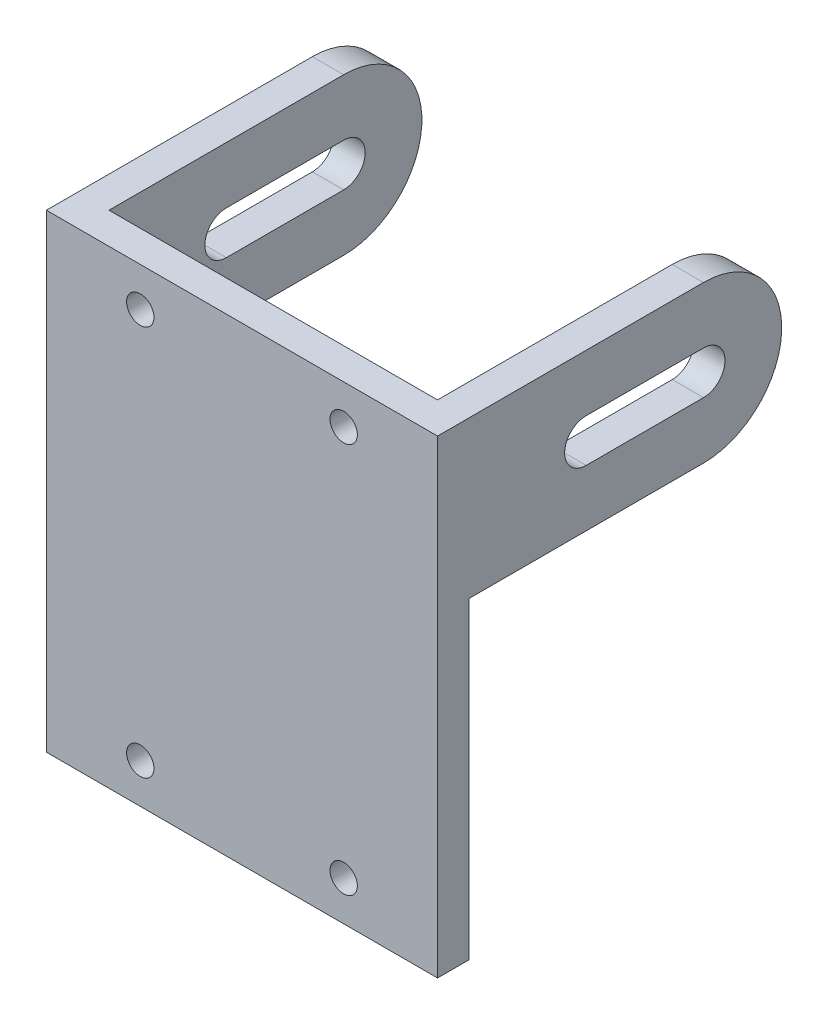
ISO-10303-21;
HEADER;
FILE_DESCRIPTION(('STEP AP214'),'2;1');
FILE_NAME('part.step','',(''),(''),'','','');
FILE_SCHEMA(('AUTOMOTIVE_DESIGN { 1 0 10303 214 1 1 1 1 }'));
ENDSEC;
DATA;
#1=APPLICATION_CONTEXT('core data for automotive mechanical design processes');
#2=APPLICATION_PROTOCOL_DEFINITION('international standard','automotive_design',2000,#1);
#3=PRODUCT_CONTEXT('',#1,'mechanical');
#4=PRODUCT('Part','Part','',(#3));
#5=PRODUCT_RELATED_PRODUCT_CATEGORY('part','',(#4));
#6=PRODUCT_DEFINITION_FORMATION('','',#4);
#7=PRODUCT_DEFINITION_CONTEXT('part definition',#1,'design');
#8=PRODUCT_DEFINITION('design','',#6,#7);
#9=PRODUCT_DEFINITION_SHAPE('','',#8);
#10=(LENGTH_UNIT() NAMED_UNIT(*) SI_UNIT(.MILLI.,.METRE.));
#11=(NAMED_UNIT(*) PLANE_ANGLE_UNIT() SI_UNIT($,.RADIAN.));
#12=(NAMED_UNIT(*) SI_UNIT($,.STERADIAN.) SOLID_ANGLE_UNIT());
#13=UNCERTAINTY_MEASURE_WITH_UNIT(LENGTH_MEASURE(1.E-05),#10,'distance_accuracy_value','');
#14=(GEOMETRIC_REPRESENTATION_CONTEXT(3) GLOBAL_UNCERTAINTY_ASSIGNED_CONTEXT((#13)) GLOBAL_UNIT_ASSIGNED_CONTEXT((#10,
#11,#12)) REPRESENTATION_CONTEXT('',''));
#15=CARTESIAN_POINT('',(0.,0.,0.));
#16=DIRECTION('',(0.,0.,1.));
#17=DIRECTION('',(1.,0.,0.));
#18=AXIS2_PLACEMENT_3D('',#15,#16,#17);
#19=CARTESIAN_POINT('',(0.,0.,0.));
#20=DIRECTION('',(0.,0.,1.));
#21=DIRECTION('',(1.,0.,0.));
#22=AXIS2_PLACEMENT_3D('',#19,#20,#21);
#23=PLANE('',#22);
#24=CARTESIAN_POINT('',(38.,-5.,0.));
#25=DIRECTION('',(0.,0.,1.));
#26=DIRECTION('',(-1.,0.,0.));
#27=AXIS2_PLACEMENT_3D('',#24,#25,#26);
#28=CIRCLE('',#27,1.75);
#29=CARTESIAN_POINT('',(36.25,-5.,0.));
#30=VERTEX_POINT('',#29);
#31=EDGE_CURVE('E327',#30,#30,#28,.T.);
#32=ORIENTED_EDGE('',*,*,#31,.T.);
#33=EDGE_LOOP('',(#32));
#34=FACE_BOUND('',#33,.T.);
#35=CARTESIAN_POINT('',(38.,-54.9374608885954,0.));
#36=DIRECTION('',(0.,0.,1.));
#37=DIRECTION('',(-1.,0.,0.));
#38=AXIS2_PLACEMENT_3D('',#35,#36,#37);
#39=CIRCLE('',#38,1.75);
#40=CARTESIAN_POINT('',(36.25,-54.9374608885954,0.));
#41=VERTEX_POINT('',#40);
#42=EDGE_CURVE('E338',#41,#41,#39,.T.);
#43=ORIENTED_EDGE('',*,*,#42,.T.);
#44=EDGE_LOOP('',(#43));
#45=FACE_BOUND('',#44,.T.);
#46=CARTESIAN_POINT('',(12.,-54.9374608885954,0.));
#47=DIRECTION('',(0.,0.,1.));
#48=DIRECTION('',(1.,0.,0.));
#49=AXIS2_PLACEMENT_3D('',#46,#47,#48);
#50=CIRCLE('',#49,1.75);
#51=CARTESIAN_POINT('',(13.75,-54.9374608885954,0.));
#52=VERTEX_POINT('',#51);
#53=EDGE_CURVE('E346',#52,#52,#50,.T.);
#54=ORIENTED_EDGE('',*,*,#53,.T.);
#55=EDGE_LOOP('',(#54));
#56=FACE_BOUND('',#55,.T.);
#57=CARTESIAN_POINT('',(12.,-5.,0.));
#58=DIRECTION('',(0.,0.,1.));
#59=DIRECTION('',(1.,0.,0.));
#60=AXIS2_PLACEMENT_3D('',#57,#58,#59);
#61=CIRCLE('',#60,1.75);
#62=CARTESIAN_POINT('',(13.75,-5.,0.));
#63=VERTEX_POINT('',#62);
#64=EDGE_CURVE('E354',#63,#63,#61,.T.);
#65=ORIENTED_EDGE('',*,*,#64,.T.);
#66=EDGE_LOOP('',(#65));
#67=FACE_BOUND('',#66,.T.);
#68=DIRECTION('',(0.,-1.,0.));
#69=VECTOR('',#68,1.);
#70=CARTESIAN_POINT('',(46.,0.,0.));
#71=LINE('',#70,#69);
#72=CARTESIAN_POINT('',(46.,0.,0.));
#73=VERTEX_POINT('',#72);
#74=CARTESIAN_POINT('',(46.,-20.,0.));
#75=VERTEX_POINT('',#74);
#76=EDGE_CURVE('E226',#73,#75,#71,.T.);
#77=ORIENTED_EDGE('',*,*,#76,.T.);
#78=DIRECTION('',(1.,0.,0.));
#79=VECTOR('',#78,1.);
#80=CARTESIAN_POINT('',(46.,-20.,0.));
#81=LINE('',#80,#79);
#82=CARTESIAN_POINT('',(50.,-20.,0.));
#83=VERTEX_POINT('',#82);
#84=EDGE_CURVE('E239',#75,#83,#81,.T.);
#85=ORIENTED_EDGE('',*,*,#84,.T.);
#86=DIRECTION('',(0.,1.,0.));
#87=VECTOR('',#86,1.);
#88=CARTESIAN_POINT('',(50.,0.,0.));
#89=LINE('',#88,#87);
#90=CARTESIAN_POINT('',(50.,-60.,0.));
#91=VERTEX_POINT('',#90);
#92=EDGE_CURVE('E385',#91,#83,#89,.T.);
#93=ORIENTED_EDGE('',*,*,#92,.F.);
#94=DIRECTION('',(1.,0.,0.));
#95=VECTOR('',#94,1.);
#96=CARTESIAN_POINT('',(0.,-60.,0.));
#97=LINE('',#96,#95);
#98=CARTESIAN_POINT('',(0.,-60.,0.));
#99=VERTEX_POINT('',#98);
#100=EDGE_CURVE('E382',#99,#91,#97,.T.);
#101=ORIENTED_EDGE('',*,*,#100,.F.);
#102=DIRECTION('',(0.,-1.,0.));
#103=VECTOR('',#102,1.);
#104=CARTESIAN_POINT('',(0.,0.,0.));
#105=LINE('',#104,#103);
#106=CARTESIAN_POINT('',(0.,-20.,0.));
#107=VERTEX_POINT('',#106);
#108=EDGE_CURVE('E362',#107,#99,#105,.T.);
#109=ORIENTED_EDGE('',*,*,#108,.F.);
#110=DIRECTION('',(-1.,0.,0.));
#111=VECTOR('',#110,1.);
#112=CARTESIAN_POINT('',(4.,-20.,0.));
#113=LINE('',#112,#111);
#114=CARTESIAN_POINT('',(4.,-20.,0.));
#115=VERTEX_POINT('',#114);
#116=EDGE_CURVE('E324',#115,#107,#113,.T.);
#117=ORIENTED_EDGE('',*,*,#116,.F.);
#118=DIRECTION('',(0.,1.,0.));
#119=VECTOR('',#118,1.);
#120=CARTESIAN_POINT('',(4.,0.,0.));
#121=LINE('',#120,#119);
#122=CARTESIAN_POINT('',(4.,0.,0.));
#123=VERTEX_POINT('',#122);
#124=EDGE_CURVE('E301',#115,#123,#121,.T.);
#125=ORIENTED_EDGE('',*,*,#124,.T.);
#126=DIRECTION('',(-1.,0.,0.));
#127=VECTOR('',#126,1.);
#128=CARTESIAN_POINT('',(0.,0.,0.));
#129=LINE('',#128,#127);
#130=EDGE_CURVE('E63',#73,#123,#129,.T.);
#131=ORIENTED_EDGE('',*,*,#130,.F.);
#132=EDGE_LOOP('',(#77,#85,#93,#101,#109,#117,#125,#131));
#133=FACE_BOUND('',#132,.T.);
#134=ADVANCED_FACE('F42',(#34,#45,#56,#67,#133),#23,.F.);
#135=CARTESIAN_POINT('',(0.,0.,4.));
#136=DIRECTION('',(0.,0.,1.));
#137=DIRECTION('',(1.,0.,0.));
#138=AXIS2_PLACEMENT_3D('',#135,#136,#137);
#139=PLANE('',#138);
#140=CARTESIAN_POINT('',(38.,-54.9374608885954,4.));
#141=DIRECTION('',(0.,0.,1.));
#142=DIRECTION('',(-1.,0.,0.));
#143=AXIS2_PLACEMENT_3D('',#140,#141,#142);
#144=CIRCLE('',#143,1.75);
#145=CARTESIAN_POINT('',(36.25,-54.9374608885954,4.));
#146=VERTEX_POINT('',#145);
#147=EDGE_CURVE('E342',#146,#146,#144,.T.);
#148=ORIENTED_EDGE('',*,*,#147,.F.);
#149=EDGE_LOOP('',(#148));
#150=FACE_BOUND('',#149,.T.);
#151=CARTESIAN_POINT('',(12.,-5.,4.));
#152=DIRECTION('',(0.,0.,1.));
#153=DIRECTION('',(1.,0.,0.));
#154=AXIS2_PLACEMENT_3D('',#151,#152,#153);
#155=CIRCLE('',#154,1.75);
#156=CARTESIAN_POINT('',(13.75,-5.,4.));
#157=VERTEX_POINT('',#156);
#158=EDGE_CURVE('E358',#157,#157,#155,.T.);
#159=ORIENTED_EDGE('',*,*,#158,.F.);
#160=EDGE_LOOP('',(#159));
#161=FACE_BOUND('',#160,.T.);
#162=DIRECTION('',(0.,-1.,0.));
#163=VECTOR('',#162,1.);
#164=CARTESIAN_POINT('',(0.,0.,4.));
#165=LINE('',#164,#163);
#166=CARTESIAN_POINT('',(0.,0.,4.));
#167=VERTEX_POINT('',#166);
#168=CARTESIAN_POINT('',(0.,-60.,4.));
#169=VERTEX_POINT('',#168);
#170=EDGE_CURVE('E366',#167,#169,#165,.T.);
#171=ORIENTED_EDGE('',*,*,#170,.T.);
#172=DIRECTION('',(1.,0.,0.));
#173=VECTOR('',#172,1.);
#174=CARTESIAN_POINT('',(0.,-60.,4.));
#175=LINE('',#174,#173);
#176=CARTESIAN_POINT('',(50.,-60.,4.));
#177=VERTEX_POINT('',#176);
#178=EDGE_CURVE('E370',#169,#177,#175,.T.);
#179=ORIENTED_EDGE('',*,*,#178,.T.);
#180=DIRECTION('',(0.,1.,0.));
#181=VECTOR('',#180,1.);
#182=CARTESIAN_POINT('',(50.,0.,4.));
#183=LINE('',#182,#181);
#184=CARTESIAN_POINT('',(50.,0.,4.));
#185=VERTEX_POINT('',#184);
#186=EDGE_CURVE('E373',#177,#185,#183,.T.);
#187=ORIENTED_EDGE('',*,*,#186,.T.);
#188=DIRECTION('',(-1.,0.,0.));
#189=VECTOR('',#188,1.);
#190=CARTESIAN_POINT('',(0.,0.,4.));
#191=LINE('',#190,#189);
#192=EDGE_CURVE('E376',#185,#167,#191,.T.);
#193=ORIENTED_EDGE('',*,*,#192,.T.);
#194=EDGE_LOOP('',(#171,#179,#187,#193));
#195=FACE_BOUND('',#194,.T.);
#196=CARTESIAN_POINT('',(12.,-54.9374608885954,4.));
#197=DIRECTION('',(0.,0.,1.));
#198=DIRECTION('',(1.,0.,0.));
#199=AXIS2_PLACEMENT_3D('',#196,#197,#198);
#200=CIRCLE('',#199,1.75);
#201=CARTESIAN_POINT('',(13.75,-54.9374608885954,4.));
#202=VERTEX_POINT('',#201);
#203=EDGE_CURVE('E350',#202,#202,#200,.T.);
#204=ORIENTED_EDGE('',*,*,#203,.F.);
#205=EDGE_LOOP('',(#204));
#206=FACE_BOUND('',#205,.T.);
#207=CARTESIAN_POINT('',(38.,-5.,4.));
#208=DIRECTION('',(0.,0.,1.));
#209=DIRECTION('',(-1.,0.,0.));
#210=AXIS2_PLACEMENT_3D('',#207,#208,#209);
#211=CIRCLE('',#210,1.75);
#212=CARTESIAN_POINT('',(36.25,-5.,4.));
#213=VERTEX_POINT('',#212);
#214=EDGE_CURVE('E334',#213,#213,#211,.T.);
#215=ORIENTED_EDGE('',*,*,#214,.F.);
#216=EDGE_LOOP('',(#215));
#217=FACE_BOUND('',#216,.T.);
#218=ADVANCED_FACE('F420',(#150,#161,#195,#206,#217),#139,.T.);
#219=CARTESIAN_POINT('',(0.,0.,4.));
#220=DIRECTION('',(1.,0.,0.));
#221=DIRECTION('',(0.,0.,-1.));
#222=AXIS2_PLACEMENT_3D('',#219,#220,#221);
#223=PLANE('',#222);
#224=DIRECTION('',(0.,0.,-1.));
#225=VECTOR('',#224,1.);
#226=CARTESIAN_POINT('',(0.,0.,4.));
#227=LINE('',#226,#225);
#228=CARTESIAN_POINT('',(0.,0.,-30.));
#229=VERTEX_POINT('',#228);
#230=EDGE_CURVE('E379',#167,#229,#227,.T.);
#231=ORIENTED_EDGE('',*,*,#230,.T.);
#232=CARTESIAN_POINT('',(0.,-10.,-30.));
#233=DIRECTION('',(-1.,0.,0.));
#234=DIRECTION('',(0.,0.,1.));
#235=AXIS2_PLACEMENT_3D('',#232,#233,#234);
#236=CIRCLE('',#235,10.);
#237=CARTESIAN_POINT('',(0.,-20.,-30.));
#238=VERTEX_POINT('',#237);
#239=EDGE_CURVE('E291',#229,#238,#236,.T.);
#240=ORIENTED_EDGE('',*,*,#239,.T.);
#241=DIRECTION('',(0.,0.,1.));
#242=VECTOR('',#241,1.);
#243=CARTESIAN_POINT('',(0.,-20.,0.));
#244=LINE('',#243,#242);
#245=EDGE_CURVE('E306',#238,#107,#244,.T.);
#246=ORIENTED_EDGE('',*,*,#245,.T.);
#247=ORIENTED_EDGE('',*,*,#108,.T.);
#248=DIRECTION('',(0.,0.,-1.));
#249=VECTOR('',#248,1.);
#250=CARTESIAN_POINT('',(0.,-60.,4.));
#251=LINE('',#250,#249);
#252=EDGE_CURVE('E11',#169,#99,#251,.T.);
#253=ORIENTED_EDGE('',*,*,#252,.F.);
#254=ORIENTED_EDGE('',*,*,#170,.F.);
#255=EDGE_LOOP('',(#231,#240,#246,#247,#253,#254));
#256=FACE_BOUND('',#255,.T.);
#257=CARTESIAN_POINT('',(0.,-10.,-30.));
#258=DIRECTION('',(-1.,0.,0.));
#259=DIRECTION('',(0.,0.,1.));
#260=AXIS2_PLACEMENT_3D('',#257,#258,#259);
#261=CIRCLE('',#260,2.75);
#262=CARTESIAN_POINT('',(0.,-7.25,-30.));
#263=VERTEX_POINT('',#262);
#264=CARTESIAN_POINT('',(0.,-12.75,-30.));
#265=VERTEX_POINT('',#264);
#266=EDGE_CURVE('E250',#263,#265,#261,.T.);
#267=ORIENTED_EDGE('',*,*,#266,.F.);
#268=DIRECTION('',(0.,0.,-1.));
#269=VECTOR('',#268,1.);
#270=CARTESIAN_POINT('',(0.,-7.25,-30.));
#271=LINE('',#270,#269);
#272=CARTESIAN_POINT('',(0.,-7.25,-15.));
#273=VERTEX_POINT('',#272);
#274=EDGE_CURVE('E262',#273,#263,#271,.T.);
#275=ORIENTED_EDGE('',*,*,#274,.F.);
#276=CARTESIAN_POINT('',(0.,-10.,-15.));
#277=DIRECTION('',(-1.,0.,0.));
#278=DIRECTION('',(0.,0.,1.));
#279=AXIS2_PLACEMENT_3D('',#276,#277,#278);
#280=CIRCLE('',#279,2.75);
#281=CARTESIAN_POINT('',(0.,-12.75,-15.));
#282=VERTEX_POINT('',#281);
#283=EDGE_CURVE('E281',#282,#273,#280,.T.);
#284=ORIENTED_EDGE('',*,*,#283,.F.);
#285=DIRECTION('',(0.,0.,1.));
#286=VECTOR('',#285,1.);
#287=CARTESIAN_POINT('',(0.,-12.75,-30.));
#288=LINE('',#287,#286);
#289=EDGE_CURVE('E277',#265,#282,#288,.T.);
#290=ORIENTED_EDGE('',*,*,#289,.F.);
#291=EDGE_LOOP('',(#267,#275,#284,#290));
#292=FACE_BOUND('',#291,.T.);
#293=ADVANCED_FACE('F44',(#256,#292),#223,.F.);
#294=CARTESIAN_POINT('',(0.,-60.,4.));
#295=DIRECTION('',(0.,1.,0.));
#296=DIRECTION('',(0.,0.,1.));
#297=AXIS2_PLACEMENT_3D('',#294,#295,#296);
#298=PLANE('',#297);
#299=ORIENTED_EDGE('',*,*,#100,.T.);
#300=DIRECTION('',(0.,0.,-1.));
#301=VECTOR('',#300,1.);
#302=CARTESIAN_POINT('',(50.,-60.,4.));
#303=LINE('',#302,#301);
#304=EDGE_CURVE('E51',#177,#91,#303,.T.);
#305=ORIENTED_EDGE('',*,*,#304,.F.);
#306=ORIENTED_EDGE('',*,*,#178,.F.);
#307=ORIENTED_EDGE('',*,*,#252,.T.);
#308=EDGE_LOOP('',(#299,#305,#306,#307));
#309=FACE_BOUND('',#308,.T.);
#310=ADVANCED_FACE('F423',(#309),#298,.F.);
#311=CARTESIAN_POINT('',(50.,0.,4.));
#312=DIRECTION('',(-1.,0.,0.));
#313=DIRECTION('',(0.,0.,1.));
#314=AXIS2_PLACEMENT_3D('',#311,#312,#313);
#315=PLANE('',#314);
#316=ORIENTED_EDGE('',*,*,#92,.T.);
#317=DIRECTION('',(0.,0.,-1.));
#318=VECTOR('',#317,1.);
#319=CARTESIAN_POINT('',(50.,-20.,0.));
#320=LINE('',#319,#318);
#321=CARTESIAN_POINT('',(50.,-20.,-30.));
#322=VERTEX_POINT('',#321);
#323=EDGE_CURVE('E218',#83,#322,#320,.T.);
#324=ORIENTED_EDGE('',*,*,#323,.T.);
#325=CARTESIAN_POINT('',(50.,-10.,-30.));
#326=DIRECTION('',(1.,0.,0.));
#327=DIRECTION('',(0.,0.,1.));
#328=AXIS2_PLACEMENT_3D('',#325,#326,#327);
#329=CIRCLE('',#328,10.);
#330=CARTESIAN_POINT('',(50.,0.,-30.));
#331=VERTEX_POINT('',#330);
#332=EDGE_CURVE('E227',#322,#331,#329,.T.);
#333=ORIENTED_EDGE('',*,*,#332,.T.);
#334=DIRECTION('',(0.,0.,-1.));
#335=VECTOR('',#334,1.);
#336=CARTESIAN_POINT('',(50.,0.,4.));
#337=LINE('',#336,#335);
#338=EDGE_CURVE('E393',#185,#331,#337,.T.);
#339=ORIENTED_EDGE('',*,*,#338,.F.);
#340=ORIENTED_EDGE('',*,*,#186,.F.);
#341=ORIENTED_EDGE('',*,*,#304,.T.);
#342=EDGE_LOOP('',(#316,#324,#333,#339,#340,#341));
#343=FACE_BOUND('',#342,.T.);
#344=DIRECTION('',(0.,0.,1.));
#345=VECTOR('',#344,1.);
#346=CARTESIAN_POINT('',(50.,-7.25,-30.));
#347=LINE('',#346,#345);
#348=CARTESIAN_POINT('',(50.,-7.25,-30.));
#349=VERTEX_POINT('',#348);
#350=CARTESIAN_POINT('',(50.,-7.25000000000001,-15.));
#351=VERTEX_POINT('',#350);
#352=EDGE_CURVE('E209',#349,#351,#347,.T.);
#353=ORIENTED_EDGE('',*,*,#352,.F.);
#354=CARTESIAN_POINT('',(50.,-10.,-30.));
#355=DIRECTION('',(1.,0.,0.));
#356=DIRECTION('',(0.,0.,-1.));
#357=AXIS2_PLACEMENT_3D('',#354,#355,#356);
#358=CIRCLE('',#357,2.75);
#359=CARTESIAN_POINT('',(50.,-12.75,-30.));
#360=VERTEX_POINT('',#359);
#361=EDGE_CURVE('E175',#360,#349,#358,.T.);
#362=ORIENTED_EDGE('',*,*,#361,.F.);
#363=DIRECTION('',(0.,0.,-1.));
#364=VECTOR('',#363,1.);
#365=CARTESIAN_POINT('',(50.,-12.75,-30.));
#366=LINE('',#365,#364);
#367=CARTESIAN_POINT('',(50.,-12.75,-15.));
#368=VERTEX_POINT('',#367);
#369=EDGE_CURVE('E196',#368,#360,#366,.T.);
#370=ORIENTED_EDGE('',*,*,#369,.F.);
#371=CARTESIAN_POINT('',(50.,-10.,-15.));
#372=DIRECTION('',(1.,0.,0.));
#373=DIRECTION('',(0.,0.,-1.));
#374=AXIS2_PLACEMENT_3D('',#371,#372,#373);
#375=CIRCLE('',#374,2.75);
#376=EDGE_CURVE('E200',#351,#368,#375,.T.);
#377=ORIENTED_EDGE('',*,*,#376,.F.);
#378=EDGE_LOOP('',(#353,#362,#370,#377));
#379=FACE_BOUND('',#378,.T.);
#380=ADVANCED_FACE('F401',(#343,#379),#315,.F.);
#381=CARTESIAN_POINT('',(0.,0.,4.));
#382=DIRECTION('',(0.,-1.,0.));
#383=DIRECTION('',(0.,0.,-1.));
#384=AXIS2_PLACEMENT_3D('',#381,#382,#383);
#385=PLANE('',#384);
#386=ORIENTED_EDGE('',*,*,#338,.T.);
#387=DIRECTION('',(1.,0.,0.));
#388=VECTOR('',#387,1.);
#389=CARTESIAN_POINT('',(46.,0.,-30.));
#390=LINE('',#389,#388);
#391=CARTESIAN_POINT('',(46.,0.,-30.));
#392=VERTEX_POINT('',#391);
#393=EDGE_CURVE('E246',#392,#331,#390,.T.);
#394=ORIENTED_EDGE('',*,*,#393,.F.);
#395=DIRECTION('',(0.,0.,1.));
#396=VECTOR('',#395,1.);
#397=CARTESIAN_POINT('',(46.,0.,0.));
#398=LINE('',#397,#396);
#399=EDGE_CURVE('E58',#392,#73,#398,.T.);
#400=ORIENTED_EDGE('',*,*,#399,.T.);
#401=ORIENTED_EDGE('',*,*,#130,.T.);
#402=DIRECTION('',(0.,0.,-1.));
#403=VECTOR('',#402,1.);
#404=CARTESIAN_POINT('',(4.,0.,0.));
#405=LINE('',#404,#403);
#406=CARTESIAN_POINT('',(4.,0.,-30.));
#407=VERTEX_POINT('',#406);
#408=EDGE_CURVE('E305',#123,#407,#405,.T.);
#409=ORIENTED_EDGE('',*,*,#408,.T.);
#410=DIRECTION('',(-1.,0.,0.));
#411=VECTOR('',#410,1.);
#412=CARTESIAN_POINT('',(4.,0.,-30.));
#413=LINE('',#412,#411);
#414=EDGE_CURVE('E317',#407,#229,#413,.T.);
#415=ORIENTED_EDGE('',*,*,#414,.T.);
#416=ORIENTED_EDGE('',*,*,#230,.F.);
#417=ORIENTED_EDGE('',*,*,#192,.F.);
#418=EDGE_LOOP('',(#386,#394,#400,#401,#409,#415,#416,#417));
#419=FACE_BOUND('',#418,.T.);
#420=ADVANCED_FACE('F417',(#419),#385,.F.);
#421=CARTESIAN_POINT('',(12.,-5.,4.));
#422=DIRECTION('',(0.,0.,-1.));
#423=DIRECTION('',(-1.,0.,0.));
#424=AXIS2_PLACEMENT_3D('',#421,#422,#423);
#425=CYLINDRICAL_SURFACE('',#424,1.75);
#426=ORIENTED_EDGE('',*,*,#158,.T.);
#427=EDGE_LOOP('',(#426));
#428=FACE_BOUND('',#427,.T.);
#429=ORIENTED_EDGE('',*,*,#64,.F.);
#430=EDGE_LOOP('',(#429));
#431=FACE_BOUND('',#430,.T.);
#432=ADVANCED_FACE('F462',(#428,#431),#425,.F.);
#433=CARTESIAN_POINT('',(12.,-54.9374608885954,4.));
#434=DIRECTION('',(0.,0.,-1.));
#435=DIRECTION('',(-1.,0.,0.));
#436=AXIS2_PLACEMENT_3D('',#433,#434,#435);
#437=CYLINDRICAL_SURFACE('',#436,1.75);
#438=ORIENTED_EDGE('',*,*,#203,.T.);
#439=EDGE_LOOP('',(#438));
#440=FACE_BOUND('',#439,.T.);
#441=ORIENTED_EDGE('',*,*,#53,.F.);
#442=EDGE_LOOP('',(#441));
#443=FACE_BOUND('',#442,.T.);
#444=ADVANCED_FACE('F493',(#440,#443),#437,.F.);
#445=CARTESIAN_POINT('',(38.,-54.9374608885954,4.));
#446=DIRECTION('',(0.,0.,-1.));
#447=DIRECTION('',(-1.,0.,0.));
#448=AXIS2_PLACEMENT_3D('',#445,#446,#447);
#449=CYLINDRICAL_SURFACE('',#448,1.75);
#450=ORIENTED_EDGE('',*,*,#147,.T.);
#451=EDGE_LOOP('',(#450));
#452=FACE_BOUND('',#451,.T.);
#453=ORIENTED_EDGE('',*,*,#42,.F.);
#454=EDGE_LOOP('',(#453));
#455=FACE_BOUND('',#454,.T.);
#456=ADVANCED_FACE('F504',(#452,#455),#449,.F.);
#457=CARTESIAN_POINT('',(38.,-5.,4.));
#458=DIRECTION('',(0.,0.,-1.));
#459=DIRECTION('',(-1.,0.,0.));
#460=AXIS2_PLACEMENT_3D('',#457,#458,#459);
#461=CYLINDRICAL_SURFACE('',#460,1.75);
#462=ORIENTED_EDGE('',*,*,#214,.T.);
#463=EDGE_LOOP('',(#462));
#464=FACE_BOUND('',#463,.T.);
#465=ORIENTED_EDGE('',*,*,#31,.F.);
#466=EDGE_LOOP('',(#465));
#467=FACE_BOUND('',#466,.T.);
#468=ADVANCED_FACE('F446',(#464,#467),#461,.F.);
#469=CARTESIAN_POINT('',(4.,-20.,0.));
#470=DIRECTION('',(0.,-1.,0.));
#471=DIRECTION('',(0.,0.,-1.));
#472=AXIS2_PLACEMENT_3D('',#469,#470,#471);
#473=PLANE('',#472);
#474=ORIENTED_EDGE('',*,*,#245,.F.);
#475=DIRECTION('',(-1.,0.,0.));
#476=VECTOR('',#475,1.);
#477=CARTESIAN_POINT('',(4.,-20.,-30.));
#478=LINE('',#477,#476);
#479=CARTESIAN_POINT('',(4.,-20.,-30.));
#480=VERTEX_POINT('',#479);
#481=EDGE_CURVE('E328',#480,#238,#478,.T.);
#482=ORIENTED_EDGE('',*,*,#481,.F.);
#483=DIRECTION('',(0.,0.,1.));
#484=VECTOR('',#483,1.);
#485=CARTESIAN_POINT('',(4.,-20.,0.));
#486=LINE('',#485,#484);
#487=EDGE_CURVE('E313',#480,#115,#486,.T.);
#488=ORIENTED_EDGE('',*,*,#487,.T.);
#489=ORIENTED_EDGE('',*,*,#116,.T.);
#490=EDGE_LOOP('',(#474,#482,#488,#489));
#491=FACE_BOUND('',#490,.T.);
#492=ADVANCED_FACE('F429',(#491),#473,.T.);
#493=CARTESIAN_POINT('',(4.,-10.,-30.));
#494=DIRECTION('',(-1.,0.,0.));
#495=DIRECTION('',(0.,0.,1.));
#496=AXIS2_PLACEMENT_3D('',#493,#494,#495);
#497=CYLINDRICAL_SURFACE('',#496,10.);
#498=ORIENTED_EDGE('',*,*,#239,.F.);
#499=ORIENTED_EDGE('',*,*,#414,.F.);
#500=CARTESIAN_POINT('',(4.,-10.,-30.));
#501=DIRECTION('',(-1.,0.,0.));
#502=DIRECTION('',(0.,0.,1.));
#503=AXIS2_PLACEMENT_3D('',#500,#501,#502);
#504=CIRCLE('',#503,10.);
#505=EDGE_CURVE('E309',#407,#480,#504,.T.);
#506=ORIENTED_EDGE('',*,*,#505,.T.);
#507=ORIENTED_EDGE('',*,*,#481,.T.);
#508=EDGE_LOOP('',(#498,#499,#506,#507));
#509=FACE_BOUND('',#508,.T.);
#510=ADVANCED_FACE('F436',(#509),#497,.T.);
#511=CARTESIAN_POINT('',(4.,-10.,-30.));
#512=DIRECTION('',(-1.,0.,0.));
#513=DIRECTION('',(0.,0.,1.));
#514=AXIS2_PLACEMENT_3D('',#511,#512,#513);
#515=PLANE('',#514);
#516=DIRECTION('',(0.,0.,-1.));
#517=VECTOR('',#516,1.);
#518=CARTESIAN_POINT('',(4.,-7.25,-30.));
#519=LINE('',#518,#517);
#520=CARTESIAN_POINT('',(4.,-7.25,-15.));
#521=VERTEX_POINT('',#520);
#522=CARTESIAN_POINT('',(4.,-7.25,-30.));
#523=VERTEX_POINT('',#522);
#524=EDGE_CURVE('E270',#521,#523,#519,.T.);
#525=ORIENTED_EDGE('',*,*,#524,.T.);
#526=CARTESIAN_POINT('',(4.,-10.,-30.));
#527=DIRECTION('',(-1.,0.,0.));
#528=DIRECTION('',(0.,0.,1.));
#529=AXIS2_PLACEMENT_3D('',#526,#527,#528);
#530=CIRCLE('',#529,2.75);
#531=CARTESIAN_POINT('',(4.,-12.75,-30.));
#532=VERTEX_POINT('',#531);
#533=EDGE_CURVE('E257',#523,#532,#530,.T.);
#534=ORIENTED_EDGE('',*,*,#533,.T.);
#535=DIRECTION('',(0.,0.,1.));
#536=VECTOR('',#535,1.);
#537=CARTESIAN_POINT('',(4.,-12.75,-30.));
#538=LINE('',#537,#536);
#539=CARTESIAN_POINT('',(4.,-12.75,-15.));
#540=VERTEX_POINT('',#539);
#541=EDGE_CURVE('E261',#532,#540,#538,.T.);
#542=ORIENTED_EDGE('',*,*,#541,.T.);
#543=CARTESIAN_POINT('',(4.,-10.,-15.));
#544=DIRECTION('',(-1.,0.,0.));
#545=DIRECTION('',(0.,0.,1.));
#546=AXIS2_PLACEMENT_3D('',#543,#544,#545);
#547=CIRCLE('',#546,2.75);
#548=EDGE_CURVE('E266',#540,#521,#547,.T.);
#549=ORIENTED_EDGE('',*,*,#548,.T.);
#550=EDGE_LOOP('',(#525,#534,#542,#549));
#551=FACE_BOUND('',#550,.T.);
#552=ORIENTED_EDGE('',*,*,#124,.F.);
#553=ORIENTED_EDGE('',*,*,#487,.F.);
#554=ORIENTED_EDGE('',*,*,#505,.F.);
#555=ORIENTED_EDGE('',*,*,#408,.F.);
#556=EDGE_LOOP('',(#552,#553,#554,#555));
#557=FACE_BOUND('',#556,.T.);
#558=ADVANCED_FACE('F433',(#551,#557),#515,.F.);
#559=CARTESIAN_POINT('',(4.,-10.,-30.));
#560=DIRECTION('',(-1.,0.,0.));
#561=DIRECTION('',(0.,0.,1.));
#562=AXIS2_PLACEMENT_3D('',#559,#560,#561);
#563=CYLINDRICAL_SURFACE('',#562,2.75);
#564=ORIENTED_EDGE('',*,*,#266,.T.);
#565=DIRECTION('',(-1.,0.,0.));
#566=VECTOR('',#565,1.);
#567=CARTESIAN_POINT('',(4.,-12.75,-30.));
#568=LINE('',#567,#566);
#569=EDGE_CURVE('E274',#532,#265,#568,.T.);
#570=ORIENTED_EDGE('',*,*,#569,.F.);
#571=ORIENTED_EDGE('',*,*,#533,.F.);
#572=DIRECTION('',(-1.,0.,0.));
#573=VECTOR('',#572,1.);
#574=CARTESIAN_POINT('',(4.,-7.25,-30.));
#575=LINE('',#574,#573);
#576=EDGE_CURVE('E288',#523,#263,#575,.T.);
#577=ORIENTED_EDGE('',*,*,#576,.T.);
#578=EDGE_LOOP('',(#564,#570,#571,#577));
#579=FACE_BOUND('',#578,.T.);
#580=ADVANCED_FACE('F443',(#579),#563,.F.);
#581=CARTESIAN_POINT('',(4.,-7.25,-30.));
#582=DIRECTION('',(0.,1.,0.));
#583=DIRECTION('',(0.,0.,1.));
#584=AXIS2_PLACEMENT_3D('',#581,#582,#583);
#585=PLANE('',#584);
#586=ORIENTED_EDGE('',*,*,#274,.T.);
#587=ORIENTED_EDGE('',*,*,#576,.F.);
#588=ORIENTED_EDGE('',*,*,#524,.F.);
#589=DIRECTION('',(-1.,0.,0.));
#590=VECTOR('',#589,1.);
#591=CARTESIAN_POINT('',(4.,-7.25,-15.));
#592=LINE('',#591,#590);
#593=EDGE_CURVE('E292',#521,#273,#592,.T.);
#594=ORIENTED_EDGE('',*,*,#593,.T.);
#595=EDGE_LOOP('',(#586,#587,#588,#594));
#596=FACE_BOUND('',#595,.T.);
#597=ADVANCED_FACE('F553',(#596),#585,.F.);
#598=CARTESIAN_POINT('',(4.,-10.,-15.));
#599=DIRECTION('',(-1.,0.,0.));
#600=DIRECTION('',(0.,0.,1.));
#601=AXIS2_PLACEMENT_3D('',#598,#599,#600);
#602=CYLINDRICAL_SURFACE('',#601,2.75);
#603=ORIENTED_EDGE('',*,*,#283,.T.);
#604=ORIENTED_EDGE('',*,*,#593,.F.);
#605=ORIENTED_EDGE('',*,*,#548,.F.);
#606=DIRECTION('',(-1.,0.,0.));
#607=VECTOR('',#606,1.);
#608=CARTESIAN_POINT('',(4.,-12.75,-15.));
#609=LINE('',#608,#607);
#610=EDGE_CURVE('E295',#540,#282,#609,.T.);
#611=ORIENTED_EDGE('',*,*,#610,.T.);
#612=EDGE_LOOP('',(#603,#604,#605,#611));
#613=FACE_BOUND('',#612,.T.);
#614=ADVANCED_FACE('F564',(#613),#602,.F.);
#615=CARTESIAN_POINT('',(4.,-12.75,-30.));
#616=DIRECTION('',(0.,-1.,0.));
#617=DIRECTION('',(0.,0.,-1.));
#618=AXIS2_PLACEMENT_3D('',#615,#616,#617);
#619=PLANE('',#618);
#620=ORIENTED_EDGE('',*,*,#289,.T.);
#621=ORIENTED_EDGE('',*,*,#610,.F.);
#622=ORIENTED_EDGE('',*,*,#541,.F.);
#623=ORIENTED_EDGE('',*,*,#569,.T.);
#624=EDGE_LOOP('',(#620,#621,#622,#623));
#625=FACE_BOUND('',#624,.T.);
#626=ADVANCED_FACE('F575',(#625),#619,.F.);
#627=CARTESIAN_POINT('',(46.,-10.,-30.));
#628=DIRECTION('',(1.,0.,0.));
#629=DIRECTION('',(0.,0.,-1.));
#630=AXIS2_PLACEMENT_3D('',#627,#628,#629);
#631=CYLINDRICAL_SURFACE('',#630,10.);
#632=ORIENTED_EDGE('',*,*,#332,.F.);
#633=DIRECTION('',(1.,0.,0.));
#634=VECTOR('',#633,1.);
#635=CARTESIAN_POINT('',(46.,-20.,-30.));
#636=LINE('',#635,#634);
#637=CARTESIAN_POINT('',(46.,-20.,-30.));
#638=VERTEX_POINT('',#637);
#639=EDGE_CURVE('E251',#638,#322,#636,.T.);
#640=ORIENTED_EDGE('',*,*,#639,.F.);
#641=CARTESIAN_POINT('',(46.,-10.,-30.));
#642=DIRECTION('',(1.,0.,0.));
#643=DIRECTION('',(0.,0.,1.));
#644=AXIS2_PLACEMENT_3D('',#641,#642,#643);
#645=CIRCLE('',#644,10.);
#646=EDGE_CURVE('E235',#638,#392,#645,.T.);
#647=ORIENTED_EDGE('',*,*,#646,.T.);
#648=ORIENTED_EDGE('',*,*,#393,.T.);
#649=EDGE_LOOP('',(#632,#640,#647,#648));
#650=FACE_BOUND('',#649,.T.);
#651=ADVANCED_FACE('F414',(#650),#631,.T.);
#652=CARTESIAN_POINT('',(46.,-20.,0.));
#653=DIRECTION('',(0.,-1.,0.));
#654=DIRECTION('',(0.,0.,-1.));
#655=AXIS2_PLACEMENT_3D('',#652,#653,#654);
#656=PLANE('',#655);
#657=ORIENTED_EDGE('',*,*,#323,.F.);
#658=ORIENTED_EDGE('',*,*,#84,.F.);
#659=DIRECTION('',(0.,0.,-1.));
#660=VECTOR('',#659,1.);
#661=CARTESIAN_POINT('',(46.,-20.,0.));
#662=LINE('',#661,#660);
#663=EDGE_CURVE('E231',#75,#638,#662,.T.);
#664=ORIENTED_EDGE('',*,*,#663,.T.);
#665=ORIENTED_EDGE('',*,*,#639,.T.);
#666=EDGE_LOOP('',(#657,#658,#664,#665));
#667=FACE_BOUND('',#666,.T.);
#668=ADVANCED_FACE('F410',(#667),#656,.T.);
#669=CARTESIAN_POINT('',(46.,-10.,-30.));
#670=DIRECTION('',(-1.,0.,0.));
#671=DIRECTION('',(0.,0.,1.));
#672=AXIS2_PLACEMENT_3D('',#669,#670,#671);
#673=PLANE('',#672);
#674=CARTESIAN_POINT('',(46.,-10.,-30.));
#675=DIRECTION('',(1.,0.,0.));
#676=DIRECTION('',(0.,0.,-1.));
#677=AXIS2_PLACEMENT_3D('',#674,#675,#676);
#678=CIRCLE('',#677,2.75);
#679=CARTESIAN_POINT('',(46.,-12.75,-30.));
#680=VERTEX_POINT('',#679);
#681=CARTESIAN_POINT('',(46.,-7.25,-30.));
#682=VERTEX_POINT('',#681);
#683=EDGE_CURVE('E172',#680,#682,#678,.T.);
#684=ORIENTED_EDGE('',*,*,#683,.T.);
#685=DIRECTION('',(0.,0.,1.));
#686=VECTOR('',#685,1.);
#687=CARTESIAN_POINT('',(46.,-7.25,-30.));
#688=LINE('',#687,#686);
#689=CARTESIAN_POINT('',(46.,-7.25000000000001,-15.));
#690=VERTEX_POINT('',#689);
#691=EDGE_CURVE('E185',#682,#690,#688,.T.);
#692=ORIENTED_EDGE('',*,*,#691,.T.);
#693=CARTESIAN_POINT('',(46.,-10.,-15.));
#694=DIRECTION('',(1.,0.,0.));
#695=DIRECTION('',(0.,0.,-1.));
#696=AXIS2_PLACEMENT_3D('',#693,#694,#695);
#697=CIRCLE('',#696,2.75);
#698=CARTESIAN_POINT('',(46.,-12.75,-15.));
#699=VERTEX_POINT('',#698);
#700=EDGE_CURVE('E190',#690,#699,#697,.T.);
#701=ORIENTED_EDGE('',*,*,#700,.T.);
#702=DIRECTION('',(0.,0.,-1.));
#703=VECTOR('',#702,1.);
#704=CARTESIAN_POINT('',(46.,-12.75,-30.));
#705=LINE('',#704,#703);
#706=EDGE_CURVE('E181',#699,#680,#705,.T.);
#707=ORIENTED_EDGE('',*,*,#706,.T.);
#708=EDGE_LOOP('',(#684,#692,#701,#707));
#709=FACE_BOUND('',#708,.T.);
#710=ORIENTED_EDGE('',*,*,#399,.F.);
#711=ORIENTED_EDGE('',*,*,#646,.F.);
#712=ORIENTED_EDGE('',*,*,#663,.F.);
#713=ORIENTED_EDGE('',*,*,#76,.F.);
#714=EDGE_LOOP('',(#710,#711,#712,#713));
#715=FACE_BOUND('',#714,.T.);
#716=ADVANCED_FACE('F192',(#709,#715),#673,.T.);
#717=CARTESIAN_POINT('',(46.,-10.,-30.));
#718=DIRECTION('',(1.,0.,0.));
#719=DIRECTION('',(0.,0.,-1.));
#720=AXIS2_PLACEMENT_3D('',#717,#718,#719);
#721=CYLINDRICAL_SURFACE('',#720,2.75);
#722=ORIENTED_EDGE('',*,*,#361,.T.);
#723=DIRECTION('',(1.,0.,0.));
#724=VECTOR('',#723,1.);
#725=CARTESIAN_POINT('',(46.,-7.25,-30.));
#726=LINE('',#725,#724);
#727=EDGE_CURVE('E168',#682,#349,#726,.T.);
#728=ORIENTED_EDGE('',*,*,#727,.F.);
#729=ORIENTED_EDGE('',*,*,#683,.F.);
#730=DIRECTION('',(1.,0.,0.));
#731=VECTOR('',#730,1.);
#732=CARTESIAN_POINT('',(46.,-12.75,-30.));
#733=LINE('',#732,#731);
#734=EDGE_CURVE('E215',#680,#360,#733,.T.);
#735=ORIENTED_EDGE('',*,*,#734,.T.);
#736=EDGE_LOOP('',(#722,#728,#729,#735));
#737=FACE_BOUND('',#736,.T.);
#738=ADVANCED_FACE('F170',(#737),#721,.F.);
#739=CARTESIAN_POINT('',(46.,-12.75,-30.));
#740=DIRECTION('',(0.,-1.,0.));
#741=DIRECTION('',(0.,0.,-1.));
#742=AXIS2_PLACEMENT_3D('',#739,#740,#741);
#743=PLANE('',#742);
#744=ORIENTED_EDGE('',*,*,#369,.T.);
#745=ORIENTED_EDGE('',*,*,#734,.F.);
#746=ORIENTED_EDGE('',*,*,#706,.F.);
#747=DIRECTION('',(1.,0.,0.));
#748=VECTOR('',#747,1.);
#749=CARTESIAN_POINT('',(46.,-12.75,-15.));
#750=LINE('',#749,#748);
#751=EDGE_CURVE('E219',#699,#368,#750,.T.);
#752=ORIENTED_EDGE('',*,*,#751,.T.);
#753=EDGE_LOOP('',(#744,#745,#746,#752));
#754=FACE_BOUND('',#753,.T.);
#755=ADVANCED_FACE('F638',(#754),#743,.F.);
#756=CARTESIAN_POINT('',(46.,-10.,-15.));
#757=DIRECTION('',(1.,0.,0.));
#758=DIRECTION('',(0.,0.,-1.));
#759=AXIS2_PLACEMENT_3D('',#756,#757,#758);
#760=CYLINDRICAL_SURFACE('',#759,2.75);
#761=ORIENTED_EDGE('',*,*,#376,.T.);
#762=ORIENTED_EDGE('',*,*,#751,.F.);
#763=ORIENTED_EDGE('',*,*,#700,.F.);
#764=DIRECTION('',(1.,0.,0.));
#765=VECTOR('',#764,1.);
#766=CARTESIAN_POINT('',(46.,-7.25000000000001,-15.));
#767=LINE('',#766,#765);
#768=EDGE_CURVE('E180',#690,#351,#767,.T.);
#769=ORIENTED_EDGE('',*,*,#768,.T.);
#770=EDGE_LOOP('',(#761,#762,#763,#769));
#771=FACE_BOUND('',#770,.T.);
#772=ADVANCED_FACE('F648',(#771),#760,.F.);
#773=CARTESIAN_POINT('',(46.,-7.25,-30.));
#774=DIRECTION('',(0.,1.,0.));
#775=DIRECTION('',(0.,0.,1.));
#776=AXIS2_PLACEMENT_3D('',#773,#774,#775);
#777=PLANE('',#776);
#778=ORIENTED_EDGE('',*,*,#352,.T.);
#779=ORIENTED_EDGE('',*,*,#768,.F.);
#780=ORIENTED_EDGE('',*,*,#691,.F.);
#781=ORIENTED_EDGE('',*,*,#727,.T.);
#782=EDGE_LOOP('',(#778,#779,#780,#781));
#783=FACE_BOUND('',#782,.T.);
#784=ADVANCED_FACE('F186',(#783),#777,.F.);
#785=CLOSED_SHELL('',(#134,#218,#293,#310,#380,#420,#432,#444,#456,#468,#492,#510,#558,#580,
#597,#614,#626,#651,#668,#716,#738,#755,#772,#784));
#786=MANIFOLD_SOLID_BREP('B2',#785);
#787=ADVANCED_BREP_SHAPE_REPRESENTATION('',(#18,#786),#14);
#788=SHAPE_DEFINITION_REPRESENTATION(#9,#787);
ENDSEC;
END-ISO-10303-21;
